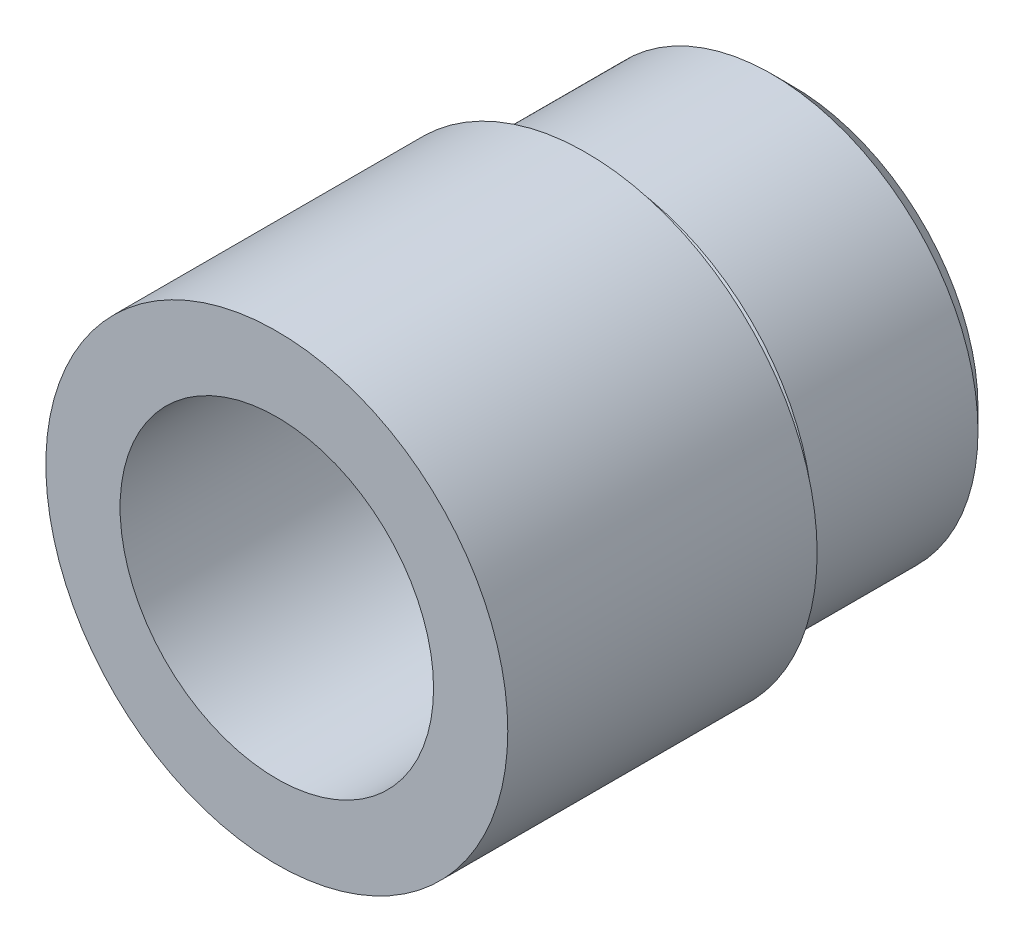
from build123d import *


with BuildPart() as part:
    # Sketch1 → Revolve1 (revolve)
    with BuildSketch(Plane(origin=(0, 0, 0), x_dir=(0, 0, -1), z_dir=(1, 0, 0)), mode=Mode.PRIVATE) as revolve1_sk:
        Polygon((16.394965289, 9.652), (16.394965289, 14.224), (35.444965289, 14.224), (35.444965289, 11.43), (36.714965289, 12.7), (46.874965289, 12.7), (48.144965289, 11.43), (48.144965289, 9.652), align=None)
    revolve(revolve1_sk.sketch.rotate(Axis((0, 0, 0), (0, 0, -1)), 90), axis=Axis((0, 0, 0), (0, 0, -1)))


solid = part.part
